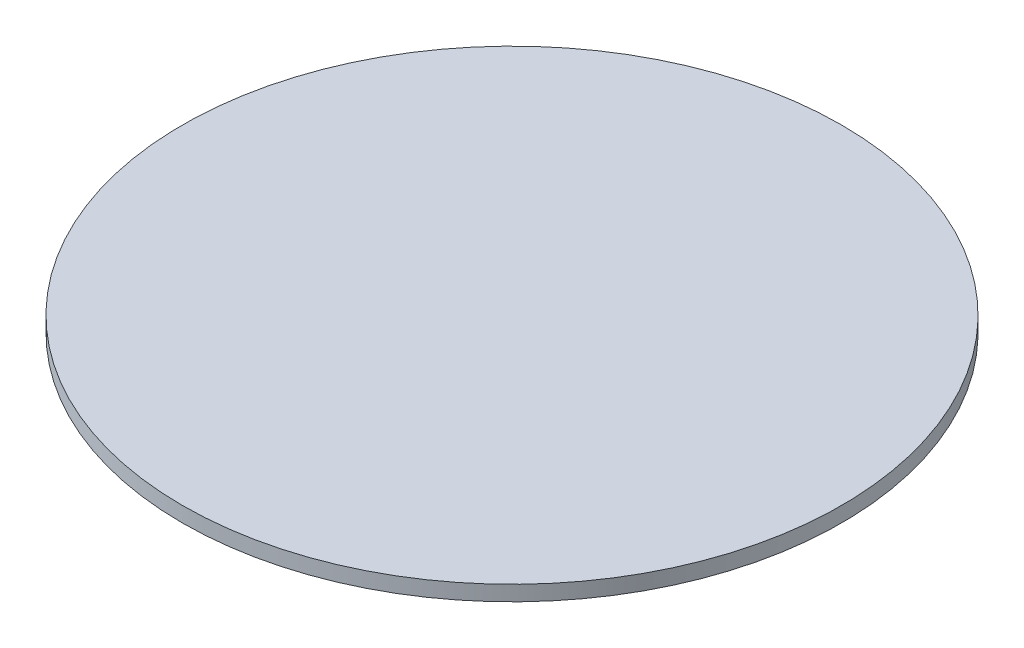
from build123d import *

# Parameters (mm, degrees)
CROQUIS1_R              = 6.5
SALIENTE_EXTRUIR1_DEPTH = 0.3


with BuildPart() as part:
    # Croquis1 → Saliente-Extruir1 (new body)
    with BuildSketch(Plane(origin=(0, 0, 0), x_dir=(1, 0, 0), z_dir=(0, 1, 0))):
        with Locations(Location((0, 0, 0), (0, 0, 270))):
            Circle(CROQUIS1_R)
    extrude(amount=SALIENTE_EXTRUIR1_DEPTH)


solid = part.part
